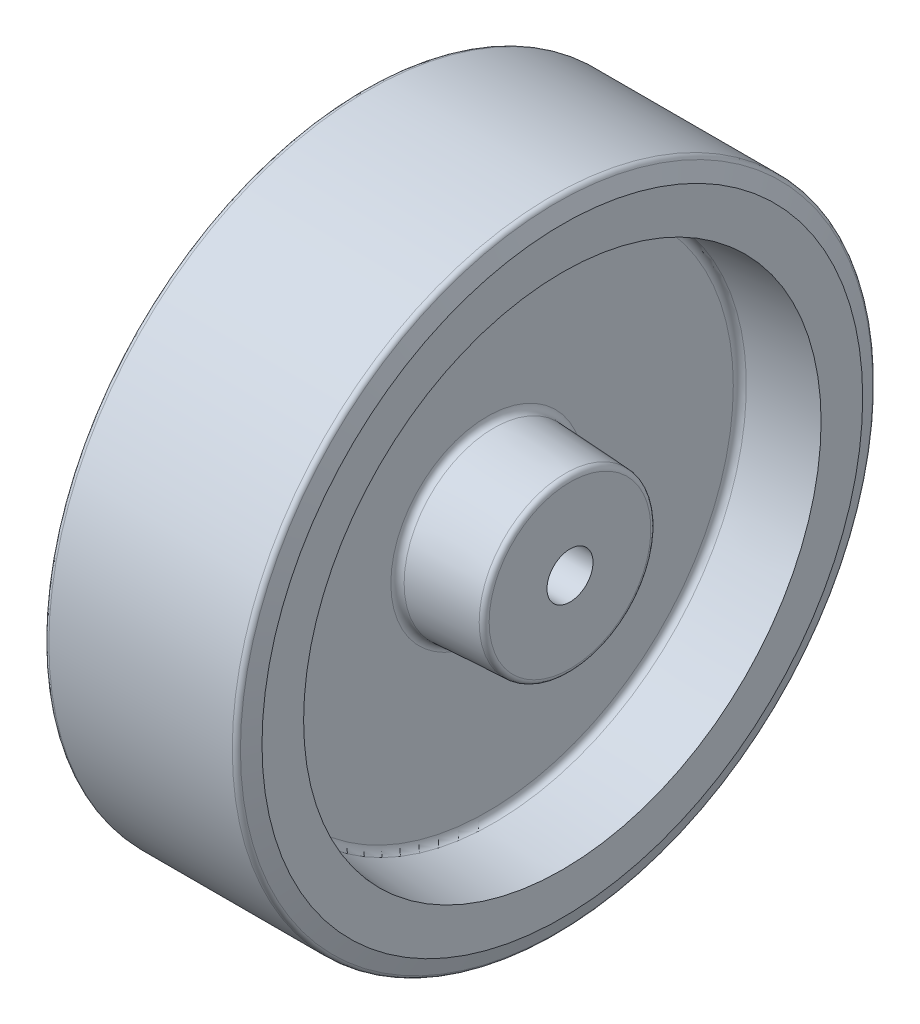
from build123d import *


with BuildPart() as part:
    # Schizzo1 → Rivoluzione1 (revolve)
    with BuildSketch(Plane.XY, mode=Mode.PRIVATE) as rivoluzione1_sk:
        with BuildLine():
            Line((-43, 9), (43, 9))
            Line((43, 9), (43, 31.64))
            ThreePointArc((43, 31.64), (42.450748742, 33.016709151), (41.104671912, 33.63725907))
            Line((41.104671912, 33.63725907), (13.200262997, 35.099667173))
            ThreePointArc((13.200262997, 35.099667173), (11.403250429, 35.928101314), (10.67, 37.766008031))
            Line((10.67, 37.766008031), (10.67, 96.207880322))
            ThreePointArc((10.67, 96.207880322), (11.371469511, 98.011706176), (13.107294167, 98.867720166))
            Line((13.107294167, 98.867720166), (40, 101.220527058))
            Line((40, 101.220527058), (40, 117.500527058))
            Line((40, 117.500527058), (37.749385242, 123.684040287))
            ThreePointArc((37.749385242, 123.684040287), (37.017152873, 124.638304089), (35.87, 125))
            Line((35.87, 125), (-35.87, 125))
            ThreePointArc((-35.87, 125), (-37.017152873, 124.638304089), (-37.749385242, 123.684040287))
            Line((-37.749385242, 123.684040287), (-40, 117.500527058))
            Line((-40, 117.500527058), (-40, 101.220527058))
            Line((-40, 101.220527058), (-13.107294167, 98.867720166))
            ThreePointArc((-13.107294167, 98.867720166), (-11.371469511, 98.011706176), (-10.67, 96.207880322))
            Line((-10.67, 96.207880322), (-10.67, 37.766008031))
            ThreePointArc((-10.67, 37.766008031), (-11.403250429, 35.928101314), (-13.200262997, 35.099667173))
            Line((-13.200262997, 35.099667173), (-41.104671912, 33.63725907))
            ThreePointArc((-41.104671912, 33.63725907), (-42.450748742, 33.016709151), (-43, 31.64))
            Line((-43, 31.64), (-43, 9))
        make_face()
    revolve(rivoluzione1_sk.sketch.rotate(Axis((-469.674938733, 0, 0), (1, 0, 0)), 90), axis=Axis((-469.674938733, 0, 0), (1, 0, 0)))


solid = part.part
